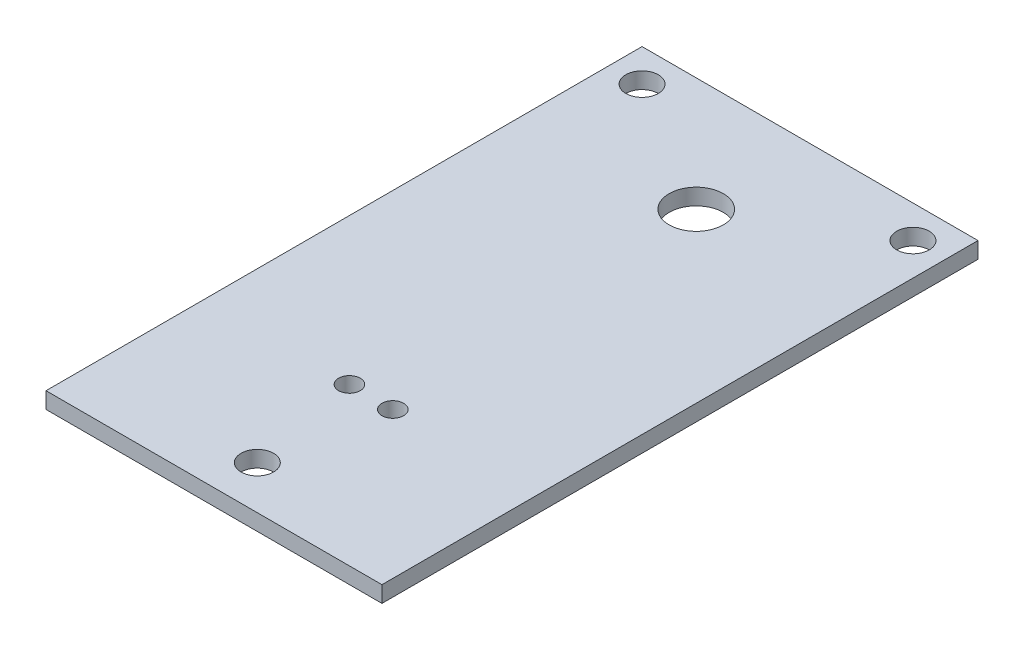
ISO-10303-21;
HEADER;
FILE_DESCRIPTION(('STEP AP214'),'2;1');
FILE_NAME('part.step','',(''),(''),'','','');
FILE_SCHEMA(('AUTOMOTIVE_DESIGN { 1 0 10303 214 1 1 1 1 }'));
ENDSEC;
DATA;
#1=APPLICATION_CONTEXT('core data for automotive mechanical design processes');
#2=APPLICATION_PROTOCOL_DEFINITION('international standard','automotive_design',2000,#1);
#3=PRODUCT_CONTEXT('',#1,'mechanical');
#4=PRODUCT('Part','Part','',(#3));
#5=PRODUCT_RELATED_PRODUCT_CATEGORY('part','',(#4));
#6=PRODUCT_DEFINITION_FORMATION('','',#4);
#7=PRODUCT_DEFINITION_CONTEXT('part definition',#1,'design');
#8=PRODUCT_DEFINITION('design','',#6,#7);
#9=PRODUCT_DEFINITION_SHAPE('','',#8);
#10=(LENGTH_UNIT() NAMED_UNIT(*) SI_UNIT(.MILLI.,.METRE.));
#11=(NAMED_UNIT(*) PLANE_ANGLE_UNIT() SI_UNIT($,.RADIAN.));
#12=(NAMED_UNIT(*) SI_UNIT($,.STERADIAN.) SOLID_ANGLE_UNIT());
#13=UNCERTAINTY_MEASURE_WITH_UNIT(LENGTH_MEASURE(1.E-05),#10,'distance_accuracy_value','');
#14=(GEOMETRIC_REPRESENTATION_CONTEXT(3) GLOBAL_UNCERTAINTY_ASSIGNED_CONTEXT((#13)) GLOBAL_UNIT_ASSIGNED_CONTEXT((#10,
#11,#12)) REPRESENTATION_CONTEXT('',''));
#15=CARTESIAN_POINT('',(0.,0.,0.));
#16=DIRECTION('',(0.,0.,1.));
#17=DIRECTION('',(1.,0.,0.));
#18=AXIS2_PLACEMENT_3D('',#15,#16,#17);
#19=CARTESIAN_POINT('',(0.,3.,-110.));
#20=DIRECTION('',(0.,-1.,0.));
#21=DIRECTION('',(0.,0.,-1.));
#22=AXIS2_PLACEMENT_3D('',#19,#20,#21);
#23=PLANE('',#22);
#24=CARTESIAN_POINT('',(31.,3.,-8.));
#25=DIRECTION('',(0.,1.,0.));
#26=DIRECTION('',(0.,0.,1.));
#27=AXIS2_PLACEMENT_3D('',#24,#25,#26);
#28=CIRCLE('',#27,3.);
#29=CARTESIAN_POINT('',(31.,3.,-5.));
#30=VERTEX_POINT('',#29);
#31=EDGE_CURVE('E135',#30,#30,#28,.T.);
#32=ORIENTED_EDGE('',*,*,#31,.F.);
#33=EDGE_LOOP('',(#32));
#34=FACE_BOUND('',#33,.T.);
#35=CARTESIAN_POINT('',(27.,3.,-29.));
#36=DIRECTION('',(0.,1.,0.));
#37=DIRECTION('',(0.,0.,1.));
#38=AXIS2_PLACEMENT_3D('',#35,#36,#37);
#39=CIRCLE('',#38,2.);
#40=CARTESIAN_POINT('',(27.,3.,-27.));
#41=VERTEX_POINT('',#40);
#42=EDGE_CURVE('E149',#41,#41,#39,.T.);
#43=ORIENTED_EDGE('',*,*,#42,.F.);
#44=EDGE_LOOP('',(#43));
#45=FACE_BOUND('',#44,.T.);
#46=CARTESIAN_POINT('',(6.,3.,-104.));
#47=DIRECTION('',(0.,1.,0.));
#48=DIRECTION('',(0.,0.,1.));
#49=AXIS2_PLACEMENT_3D('',#46,#47,#48);
#50=CIRCLE('',#49,3.);
#51=CARTESIAN_POINT('',(6.,3.,-101.));
#52=VERTEX_POINT('',#51);
#53=EDGE_CURVE('E93',#52,#52,#50,.T.);
#54=ORIENTED_EDGE('',*,*,#53,.F.);
#55=EDGE_LOOP('',(#54));
#56=FACE_BOUND('',#55,.T.);
#57=DIRECTION('',(0.,0.,1.));
#58=VECTOR('',#57,1.);
#59=CARTESIAN_POINT('',(0.,3.,0.));
#60=LINE('',#59,#58);
#61=CARTESIAN_POINT('',(0.,3.,-110.));
#62=VERTEX_POINT('',#61);
#63=CARTESIAN_POINT('',(0.,3.,0.));
#64=VERTEX_POINT('',#63);
#65=EDGE_CURVE('E103',#62,#64,#60,.T.);
#66=ORIENTED_EDGE('',*,*,#65,.T.);
#67=DIRECTION('',(1.,0.,0.));
#68=VECTOR('',#67,1.);
#69=CARTESIAN_POINT('',(0.,3.,0.));
#70=LINE('',#69,#68);
#71=CARTESIAN_POINT('',(62.,3.,0.));
#72=VERTEX_POINT('',#71);
#73=EDGE_CURVE('E88',#64,#72,#70,.T.);
#74=ORIENTED_EDGE('',*,*,#73,.T.);
#75=DIRECTION('',(0.,0.,-1.));
#76=VECTOR('',#75,1.);
#77=CARTESIAN_POINT('',(62.,3.,0.));
#78=LINE('',#77,#76);
#79=CARTESIAN_POINT('',(62.,3.,-110.));
#80=VERTEX_POINT('',#79);
#81=EDGE_CURVE('E54',#72,#80,#78,.T.);
#82=ORIENTED_EDGE('',*,*,#81,.T.);
#83=DIRECTION('',(-1.,0.,0.));
#84=VECTOR('',#83,1.);
#85=CARTESIAN_POINT('',(0.,3.,-110.));
#86=LINE('',#85,#84);
#87=EDGE_CURVE('E49',#80,#62,#86,.T.);
#88=ORIENTED_EDGE('',*,*,#87,.T.);
#89=EDGE_LOOP('',(#66,#74,#82,#88));
#90=FACE_BOUND('',#89,.T.);
#91=CARTESIAN_POINT('',(56.,3.,-104.));
#92=DIRECTION('',(0.,1.,0.));
#93=DIRECTION('',(0.,0.,1.));
#94=AXIS2_PLACEMENT_3D('',#91,#92,#93);
#95=CIRCLE('',#94,3.);
#96=CARTESIAN_POINT('',(56.,3.,-101.));
#97=VERTEX_POINT('',#96);
#98=EDGE_CURVE('E122',#97,#97,#95,.T.);
#99=ORIENTED_EDGE('',*,*,#98,.F.);
#100=EDGE_LOOP('',(#99));
#101=FACE_BOUND('',#100,.T.);
#102=CARTESIAN_POINT('',(35.,3.,-29.));
#103=DIRECTION('',(0.,1.,0.));
#104=DIRECTION('',(0.,0.,1.));
#105=AXIS2_PLACEMENT_3D('',#102,#103,#104);
#106=CIRCLE('',#105,2.);
#107=CARTESIAN_POINT('',(35.,3.,-27.));
#108=VERTEX_POINT('',#107);
#109=EDGE_CURVE('E126',#108,#108,#106,.T.);
#110=ORIENTED_EDGE('',*,*,#109,.F.);
#111=EDGE_LOOP('',(#110));
#112=FACE_BOUND('',#111,.T.);
#113=CARTESIAN_POINT('',(31.,3.,-89.));
#114=DIRECTION('',(0.,1.,0.));
#115=DIRECTION('',(0.,0.,1.));
#116=AXIS2_PLACEMENT_3D('',#113,#114,#115);
#117=CIRCLE('',#116,5.);
#118=CARTESIAN_POINT('',(31.,3.,-84.));
#119=VERTEX_POINT('',#118);
#120=EDGE_CURVE('E129',#119,#119,#117,.T.);
#121=ORIENTED_EDGE('',*,*,#120,.F.);
#122=EDGE_LOOP('',(#121));
#123=FACE_BOUND('',#122,.T.);
#124=ADVANCED_FACE('F34',(#34,#45,#56,#90,#101,#112,#123),#23,.F.);
#125=CARTESIAN_POINT('',(0.,0.,-110.));
#126=DIRECTION('',(0.,-1.,0.));
#127=DIRECTION('',(0.,0.,-1.));
#128=AXIS2_PLACEMENT_3D('',#125,#126,#127);
#129=PLANE('',#128);
#130=CARTESIAN_POINT('',(31.,0.,-8.));
#131=DIRECTION('',(0.,1.,0.));
#132=DIRECTION('',(0.,0.,1.));
#133=AXIS2_PLACEMENT_3D('',#130,#131,#132);
#134=CIRCLE('',#133,3.);
#135=CARTESIAN_POINT('',(31.,0.,-5.));
#136=VERTEX_POINT('',#135);
#137=EDGE_CURVE('E131',#136,#136,#134,.T.);
#138=ORIENTED_EDGE('',*,*,#137,.T.);
#139=EDGE_LOOP('',(#138));
#140=FACE_BOUND('',#139,.T.);
#141=CARTESIAN_POINT('',(27.,0.,-29.));
#142=DIRECTION('',(0.,1.,0.));
#143=DIRECTION('',(0.,0.,1.));
#144=AXIS2_PLACEMENT_3D('',#141,#142,#143);
#145=CIRCLE('',#144,2.);
#146=CARTESIAN_POINT('',(27.,0.,-27.));
#147=VERTEX_POINT('',#146);
#148=EDGE_CURVE('E146',#147,#147,#145,.T.);
#149=ORIENTED_EDGE('',*,*,#148,.T.);
#150=EDGE_LOOP('',(#149));
#151=FACE_BOUND('',#150,.T.);
#152=CARTESIAN_POINT('',(6.,0.,-104.));
#153=DIRECTION('',(0.,1.,0.));
#154=DIRECTION('',(0.,0.,1.));
#155=AXIS2_PLACEMENT_3D('',#152,#153,#154);
#156=CIRCLE('',#155,3.);
#157=CARTESIAN_POINT('',(6.,0.,-101.));
#158=VERTEX_POINT('',#157);
#159=EDGE_CURVE('E96',#158,#158,#156,.T.);
#160=ORIENTED_EDGE('',*,*,#159,.T.);
#161=EDGE_LOOP('',(#160));
#162=FACE_BOUND('',#161,.T.);
#163=DIRECTION('',(0.,0.,1.));
#164=VECTOR('',#163,1.);
#165=CARTESIAN_POINT('',(0.,0.,0.));
#166=LINE('',#165,#164);
#167=CARTESIAN_POINT('',(0.,0.,-110.));
#168=VERTEX_POINT('',#167);
#169=CARTESIAN_POINT('',(0.,0.,0.));
#170=VERTEX_POINT('',#169);
#171=EDGE_CURVE('E80',#168,#170,#166,.T.);
#172=ORIENTED_EDGE('',*,*,#171,.F.);
#173=DIRECTION('',(-1.,0.,0.));
#174=VECTOR('',#173,1.);
#175=CARTESIAN_POINT('',(0.,0.,-110.));
#176=LINE('',#175,#174);
#177=CARTESIAN_POINT('',(62.,0.,-110.));
#178=VERTEX_POINT('',#177);
#179=EDGE_CURVE('E101',#178,#168,#176,.T.);
#180=ORIENTED_EDGE('',*,*,#179,.F.);
#181=DIRECTION('',(0.,0.,-1.));
#182=VECTOR('',#181,1.);
#183=CARTESIAN_POINT('',(62.,0.,0.));
#184=LINE('',#183,#182);
#185=CARTESIAN_POINT('',(62.,0.,0.));
#186=VERTEX_POINT('',#185);
#187=EDGE_CURVE('E81',#186,#178,#184,.T.);
#188=ORIENTED_EDGE('',*,*,#187,.F.);
#189=DIRECTION('',(1.,0.,0.));
#190=VECTOR('',#189,1.);
#191=CARTESIAN_POINT('',(0.,0.,0.));
#192=LINE('',#191,#190);
#193=EDGE_CURVE('E75',#170,#186,#192,.T.);
#194=ORIENTED_EDGE('',*,*,#193,.F.);
#195=EDGE_LOOP('',(#172,#180,#188,#194));
#196=FACE_BOUND('',#195,.T.);
#197=CARTESIAN_POINT('',(56.,0.,-104.));
#198=DIRECTION('',(0.,1.,0.));
#199=DIRECTION('',(0.,0.,1.));
#200=AXIS2_PLACEMENT_3D('',#197,#198,#199);
#201=CIRCLE('',#200,3.);
#202=CARTESIAN_POINT('',(56.,0.,-101.));
#203=VERTEX_POINT('',#202);
#204=EDGE_CURVE('E152',#203,#203,#201,.T.);
#205=ORIENTED_EDGE('',*,*,#204,.T.);
#206=EDGE_LOOP('',(#205));
#207=FACE_BOUND('',#206,.T.);
#208=CARTESIAN_POINT('',(35.,0.,-29.));
#209=DIRECTION('',(0.,1.,0.));
#210=DIRECTION('',(0.,0.,1.));
#211=AXIS2_PLACEMENT_3D('',#208,#209,#210);
#212=CIRCLE('',#211,2.);
#213=CARTESIAN_POINT('',(35.,0.,-27.));
#214=VERTEX_POINT('',#213);
#215=EDGE_CURVE('E142',#214,#214,#212,.T.);
#216=ORIENTED_EDGE('',*,*,#215,.T.);
#217=EDGE_LOOP('',(#216));
#218=FACE_BOUND('',#217,.T.);
#219=CARTESIAN_POINT('',(31.,0.,-89.));
#220=DIRECTION('',(0.,1.,0.));
#221=DIRECTION('',(0.,0.,1.));
#222=AXIS2_PLACEMENT_3D('',#219,#220,#221);
#223=CIRCLE('',#222,5.);
#224=CARTESIAN_POINT('',(31.,0.,-84.));
#225=VERTEX_POINT('',#224);
#226=EDGE_CURVE('E132',#225,#225,#223,.T.);
#227=ORIENTED_EDGE('',*,*,#226,.T.);
#228=EDGE_LOOP('',(#227));
#229=FACE_BOUND('',#228,.T.);
#230=ADVANCED_FACE('F76',(#140,#151,#162,#196,#207,#218,#229),#129,.T.);
#231=CARTESIAN_POINT('',(0.,3.,0.));
#232=DIRECTION('',(1.,0.,0.));
#233=DIRECTION('',(0.,0.,-1.));
#234=AXIS2_PLACEMENT_3D('',#231,#232,#233);
#235=PLANE('',#234);
#236=ORIENTED_EDGE('',*,*,#171,.T.);
#237=DIRECTION('',(0.,-1.,0.));
#238=VECTOR('',#237,1.);
#239=CARTESIAN_POINT('',(0.,3.,0.));
#240=LINE('',#239,#238);
#241=EDGE_CURVE('E11',#64,#170,#240,.T.);
#242=ORIENTED_EDGE('',*,*,#241,.F.);
#243=ORIENTED_EDGE('',*,*,#65,.F.);
#244=DIRECTION('',(0.,-1.,0.));
#245=VECTOR('',#244,1.);
#246=CARTESIAN_POINT('',(0.,3.,-110.));
#247=LINE('',#246,#245);
#248=EDGE_CURVE('E92',#62,#168,#247,.T.);
#249=ORIENTED_EDGE('',*,*,#248,.T.);
#250=EDGE_LOOP('',(#236,#242,#243,#249));
#251=FACE_BOUND('',#250,.T.);
#252=ADVANCED_FACE('F36',(#251),#235,.F.);
#253=CARTESIAN_POINT('',(0.,3.,0.));
#254=DIRECTION('',(0.,0.,-1.));
#255=DIRECTION('',(-1.,0.,0.));
#256=AXIS2_PLACEMENT_3D('',#253,#254,#255);
#257=PLANE('',#256);
#258=ORIENTED_EDGE('',*,*,#193,.T.);
#259=DIRECTION('',(0.,-1.,0.));
#260=VECTOR('',#259,1.);
#261=CARTESIAN_POINT('',(62.,3.,0.));
#262=LINE('',#261,#260);
#263=EDGE_CURVE('E42',#72,#186,#262,.T.);
#264=ORIENTED_EDGE('',*,*,#263,.F.);
#265=ORIENTED_EDGE('',*,*,#73,.F.);
#266=ORIENTED_EDGE('',*,*,#241,.T.);
#267=EDGE_LOOP('',(#258,#264,#265,#266));
#268=FACE_BOUND('',#267,.T.);
#269=ADVANCED_FACE('F87',(#268),#257,.F.);
#270=CARTESIAN_POINT('',(62.,3.,0.));
#271=DIRECTION('',(-1.,0.,0.));
#272=DIRECTION('',(0.,0.,1.));
#273=AXIS2_PLACEMENT_3D('',#270,#271,#272);
#274=PLANE('',#273);
#275=ORIENTED_EDGE('',*,*,#187,.T.);
#276=DIRECTION('',(0.,-1.,0.));
#277=VECTOR('',#276,1.);
#278=CARTESIAN_POINT('',(62.,3.,-110.));
#279=LINE('',#278,#277);
#280=EDGE_CURVE('E109',#80,#178,#279,.T.);
#281=ORIENTED_EDGE('',*,*,#280,.F.);
#282=ORIENTED_EDGE('',*,*,#81,.F.);
#283=ORIENTED_EDGE('',*,*,#263,.T.);
#284=EDGE_LOOP('',(#275,#281,#282,#283));
#285=FACE_BOUND('',#284,.T.);
#286=ADVANCED_FACE('F112',(#285),#274,.F.);
#287=CARTESIAN_POINT('',(0.,3.,-110.));
#288=DIRECTION('',(0.,0.,1.));
#289=DIRECTION('',(1.,0.,0.));
#290=AXIS2_PLACEMENT_3D('',#287,#288,#289);
#291=PLANE('',#290);
#292=ORIENTED_EDGE('',*,*,#179,.T.);
#293=ORIENTED_EDGE('',*,*,#248,.F.);
#294=ORIENTED_EDGE('',*,*,#87,.F.);
#295=ORIENTED_EDGE('',*,*,#280,.T.);
#296=EDGE_LOOP('',(#292,#293,#294,#295));
#297=FACE_BOUND('',#296,.T.);
#298=ADVANCED_FACE('F114',(#297),#291,.F.);
#299=CARTESIAN_POINT('',(6.,3.,-104.));
#300=DIRECTION('',(0.,-1.,0.));
#301=DIRECTION('',(0.,0.,-1.));
#302=AXIS2_PLACEMENT_3D('',#299,#300,#301);
#303=CYLINDRICAL_SURFACE('',#302,3.);
#304=ORIENTED_EDGE('',*,*,#53,.T.);
#305=EDGE_LOOP('',(#304));
#306=FACE_BOUND('',#305,.T.);
#307=ORIENTED_EDGE('',*,*,#159,.F.);
#308=EDGE_LOOP('',(#307));
#309=FACE_BOUND('',#308,.T.);
#310=ADVANCED_FACE('F159',(#306,#309),#303,.F.);
#311=CARTESIAN_POINT('',(56.,3.,-104.));
#312=DIRECTION('',(0.,-1.,0.));
#313=DIRECTION('',(0.,0.,-1.));
#314=AXIS2_PLACEMENT_3D('',#311,#312,#313);
#315=CYLINDRICAL_SURFACE('',#314,3.);
#316=ORIENTED_EDGE('',*,*,#98,.T.);
#317=EDGE_LOOP('',(#316));
#318=FACE_BOUND('',#317,.T.);
#319=ORIENTED_EDGE('',*,*,#204,.F.);
#320=EDGE_LOOP('',(#319));
#321=FACE_BOUND('',#320,.T.);
#322=ADVANCED_FACE('F161',(#318,#321),#315,.F.);
#323=CARTESIAN_POINT('',(27.,3.,-29.));
#324=DIRECTION('',(0.,-1.,0.));
#325=DIRECTION('',(0.,0.,-1.));
#326=AXIS2_PLACEMENT_3D('',#323,#324,#325);
#327=CYLINDRICAL_SURFACE('',#326,2.);
#328=ORIENTED_EDGE('',*,*,#42,.T.);
#329=EDGE_LOOP('',(#328));
#330=FACE_BOUND('',#329,.T.);
#331=ORIENTED_EDGE('',*,*,#148,.F.);
#332=EDGE_LOOP('',(#331));
#333=FACE_BOUND('',#332,.T.);
#334=ADVANCED_FACE('F168',(#330,#333),#327,.F.);
#335=CARTESIAN_POINT('',(35.,3.,-29.));
#336=DIRECTION('',(0.,-1.,0.));
#337=DIRECTION('',(0.,0.,-1.));
#338=AXIS2_PLACEMENT_3D('',#335,#336,#337);
#339=CYLINDRICAL_SURFACE('',#338,2.);
#340=ORIENTED_EDGE('',*,*,#109,.T.);
#341=EDGE_LOOP('',(#340));
#342=FACE_BOUND('',#341,.T.);
#343=ORIENTED_EDGE('',*,*,#215,.F.);
#344=EDGE_LOOP('',(#343));
#345=FACE_BOUND('',#344,.T.);
#346=ADVANCED_FACE('F231',(#342,#345),#339,.F.);
#347=CARTESIAN_POINT('',(31.,3.,-8.));
#348=DIRECTION('',(0.,-1.,0.));
#349=DIRECTION('',(0.,0.,-1.));
#350=AXIS2_PLACEMENT_3D('',#347,#348,#349);
#351=CYLINDRICAL_SURFACE('',#350,3.);
#352=ORIENTED_EDGE('',*,*,#31,.T.);
#353=EDGE_LOOP('',(#352));
#354=FACE_BOUND('',#353,.T.);
#355=ORIENTED_EDGE('',*,*,#137,.F.);
#356=EDGE_LOOP('',(#355));
#357=FACE_BOUND('',#356,.T.);
#358=ADVANCED_FACE('F239',(#354,#357),#351,.F.);
#359=CARTESIAN_POINT('',(31.,3.,-89.));
#360=DIRECTION('',(0.,-1.,0.));
#361=DIRECTION('',(0.,0.,-1.));
#362=AXIS2_PLACEMENT_3D('',#359,#360,#361);
#363=CYLINDRICAL_SURFACE('',#362,5.);
#364=ORIENTED_EDGE('',*,*,#120,.T.);
#365=EDGE_LOOP('',(#364));
#366=FACE_BOUND('',#365,.T.);
#367=ORIENTED_EDGE('',*,*,#226,.F.);
#368=EDGE_LOOP('',(#367));
#369=FACE_BOUND('',#368,.T.);
#370=ADVANCED_FACE('F248',(#366,#369),#363,.F.);
#371=CLOSED_SHELL('',(#124,#230,#252,#269,#286,#298,#310,#322,#334,#346,#358,#370));
#372=MANIFOLD_SOLID_BREP('B2',#371);
#373=ADVANCED_BREP_SHAPE_REPRESENTATION('',(#18,#372),#14);
#374=SHAPE_DEFINITION_REPRESENTATION(#9,#373);
ENDSEC;
END-ISO-10303-21;
